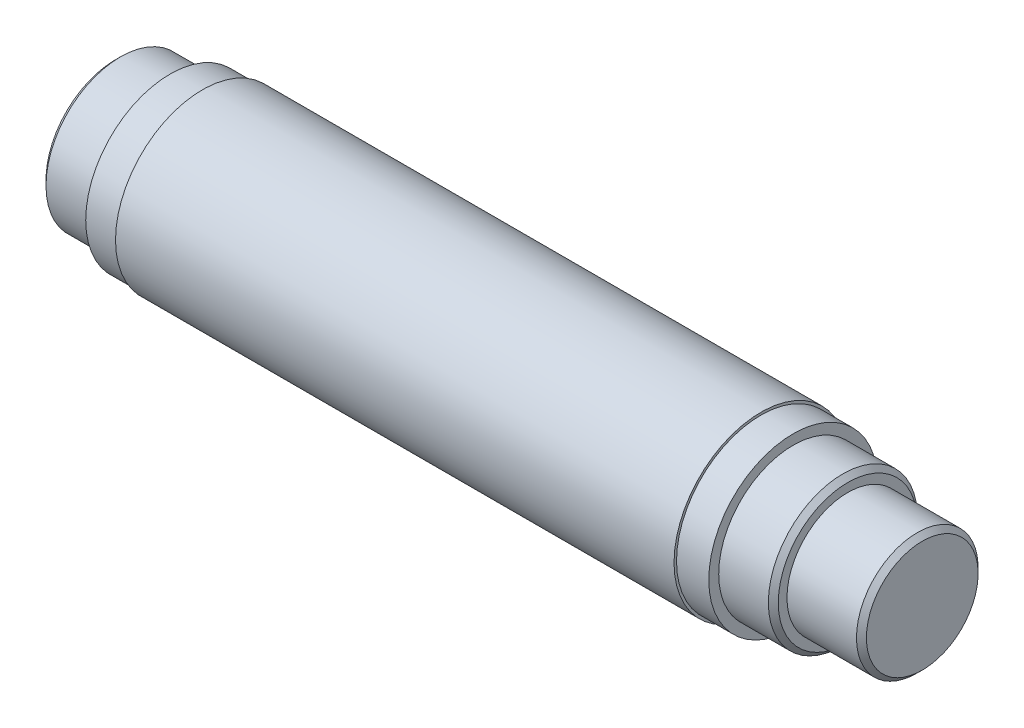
from build123d import *

# Parameters (mm, degrees)
CHAMFER_1_SIZE      = 2
SKETCH_2_R          = 25
SKETCH_2_R_2        = 24.5
CUT_EXTRUDE_1_DEPTH = 10


with BuildPart() as part:
    # Sketch 1 → Revolve 2 (revolve)
    with BuildSketch(Plane.XY, mode=Mode.PRIVATE) as revolve_2_sk:
        Polygon((0, 0), (0, 30), (22, 30), (22, 34), (35, 34), (35, 35), (260, 35), (260, 34), (273, 34), (273, 30), (295, 30), (295, 25), (305, 25), (305, 24.5), (325, 24.5), (325, 0), align=None)
    revolve(revolve_2_sk.sketch.rotate(Axis((-63.678370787, 0, 0), (1, 0, 0)), 90), axis=Axis((-63.678370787, 0, 0), (1, 0, 0)))

    # Chamfer 1
    chamfer_1_edges = [part.edges().sort_by_distance(p)[0] for p in [
        (295, 0, -30),
        (0, 0, -30),
        (325, 0, -24.5),
    ]]
    chamfer(chamfer_1_edges, length=CHAMFER_1_SIZE)

    # Sketch 2 → Cut-Extrude 1 (cut)
    with BuildSketch(Plane(origin=(305, 0, 0), x_dir=(0, 0, -1), z_dir=(1, 0, 0))):
        Circle(SKETCH_2_R)
        with Locations(Location((0, 0, 0), (0, 0, 180))):
            Circle(SKETCH_2_R_2, mode=Mode.SUBTRACT)
    extrude(amount=-CUT_EXTRUDE_1_DEPTH, mode=Mode.SUBTRACT)


solid = part.part
